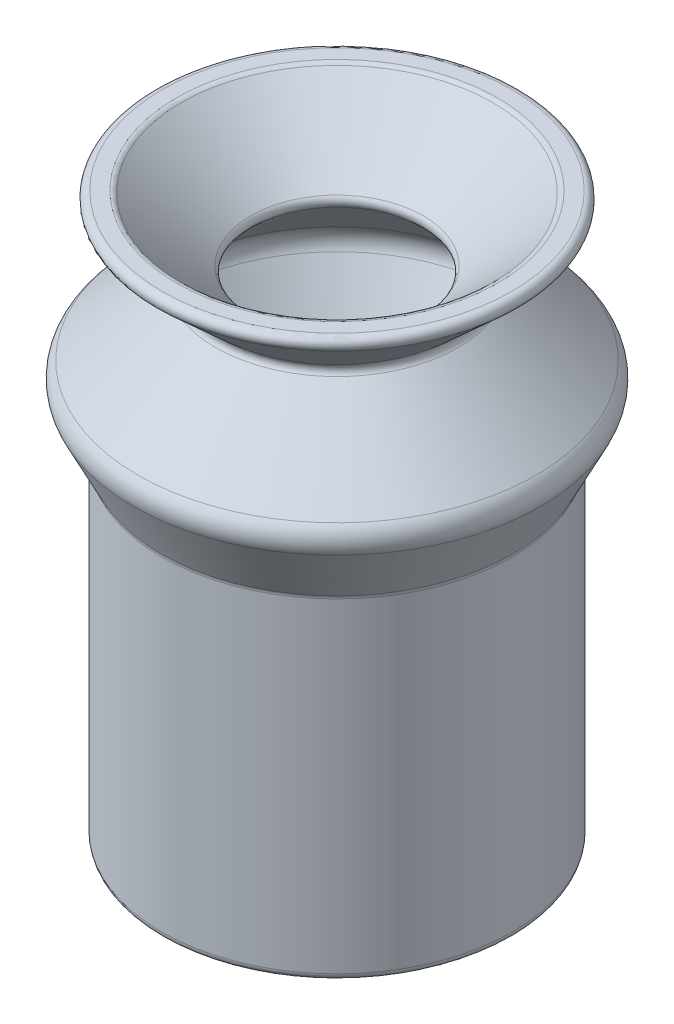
ISO-10303-21;
HEADER;
FILE_DESCRIPTION(('STEP AP214'),'2;1');
FILE_NAME('part.step','',(''),(''),'','','');
FILE_SCHEMA(('AUTOMOTIVE_DESIGN { 1 0 10303 214 1 1 1 1 }'));
ENDSEC;
DATA;
#1=APPLICATION_CONTEXT('core data for automotive mechanical design processes');
#2=APPLICATION_PROTOCOL_DEFINITION('international standard','automotive_design',2000,#1);
#3=PRODUCT_CONTEXT('',#1,'mechanical');
#4=PRODUCT('Part','Part','',(#3));
#5=PRODUCT_RELATED_PRODUCT_CATEGORY('part','',(#4));
#6=PRODUCT_DEFINITION_FORMATION('','',#4);
#7=PRODUCT_DEFINITION_CONTEXT('part definition',#1,'design');
#8=PRODUCT_DEFINITION('design','',#6,#7);
#9=PRODUCT_DEFINITION_SHAPE('','',#8);
#10=(LENGTH_UNIT() NAMED_UNIT(*) SI_UNIT(.MILLI.,.METRE.));
#11=(NAMED_UNIT(*) PLANE_ANGLE_UNIT() SI_UNIT($,.RADIAN.));
#12=(NAMED_UNIT(*) SI_UNIT($,.STERADIAN.) SOLID_ANGLE_UNIT());
#13=UNCERTAINTY_MEASURE_WITH_UNIT(LENGTH_MEASURE(1.E-05),#10,'distance_accuracy_value','');
#14=(GEOMETRIC_REPRESENTATION_CONTEXT(3) GLOBAL_UNCERTAINTY_ASSIGNED_CONTEXT((#13)) GLOBAL_UNIT_ASSIGNED_CONTEXT((#10,
#11,#12)) REPRESENTATION_CONTEXT('',''));
#15=CARTESIAN_POINT('',(0.,0.,0.));
#16=DIRECTION('',(0.,0.,1.));
#17=DIRECTION('',(1.,0.,0.));
#18=AXIS2_PLACEMENT_3D('',#15,#16,#17);
#19=CARTESIAN_POINT('',(0.,9.5,0.));
#20=DIRECTION('',(0.,-1.,0.));
#21=DIRECTION('',(0.,0.,-1.));
#22=AXIS2_PLACEMENT_3D('',#19,#20,#21);
#23=CYLINDRICAL_SURFACE('',#22,5.);
#24=CARTESIAN_POINT('',(0.,9.45278640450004,0.));
#25=DIRECTION('',(0.,1.,0.));
#26=DIRECTION('',(0.,0.,1.));
#27=AXIS2_PLACEMENT_3D('',#24,#25,#26);
#28=CIRCLE('',#27,5.);
#29=CARTESIAN_POINT('',(0.,9.45278640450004,5.));
#30=VERTEX_POINT('',#29);
#31=EDGE_CURVE('E59',#30,#30,#28,.F.);
#32=ORIENTED_EDGE('',*,*,#31,.T.);
#33=EDGE_LOOP('',(#32));
#34=FACE_BOUND('',#33,.T.);
#35=CARTESIAN_POINT('',(0.,0.200000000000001,0.));
#36=DIRECTION('',(0.,1.,0.));
#37=DIRECTION('',(0.,0.,1.));
#38=AXIS2_PLACEMENT_3D('',#35,#36,#37);
#39=CIRCLE('',#38,5.);
#40=CARTESIAN_POINT('',(0.,0.200000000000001,5.));
#41=VERTEX_POINT('',#40);
#42=EDGE_CURVE('E62',#41,#41,#39,.T.);
#43=ORIENTED_EDGE('',*,*,#42,.T.);
#44=EDGE_LOOP('',(#43));
#45=FACE_BOUND('',#44,.T.);
#46=ADVANCED_FACE('F33',(#34,#45),#23,.T.);
#47=CARTESIAN_POINT('',(0.,0.,0.));
#48=DIRECTION('',(0.,1.,0.));
#49=DIRECTION('',(0.,0.,1.));
#50=AXIS2_PLACEMENT_3D('',#47,#48,#49);
#51=PLANE('',#50);
#52=CARTESIAN_POINT('',(0.,0.,0.));
#53=DIRECTION('',(0.,1.,0.));
#54=DIRECTION('',(0.,0.,1.));
#55=AXIS2_PLACEMENT_3D('',#52,#53,#54);
#56=CIRCLE('',#55,2.5);
#57=CARTESIAN_POINT('',(0.,0.,2.5));
#58=VERTEX_POINT('',#57);
#59=EDGE_CURVE('E53',#58,#58,#56,.T.);
#60=ORIENTED_EDGE('',*,*,#59,.T.);
#61=EDGE_LOOP('',(#60));
#62=FACE_BOUND('',#61,.T.);
#63=CARTESIAN_POINT('',(0.,0.,0.));
#64=DIRECTION('',(0.,1.,0.));
#65=DIRECTION('',(0.,0.,1.));
#66=AXIS2_PLACEMENT_3D('',#63,#64,#65);
#67=CIRCLE('',#66,4.8);
#68=CARTESIAN_POINT('',(0.,0.,4.8));
#69=VERTEX_POINT('',#68);
#70=EDGE_CURVE('E56',#69,#69,#67,.F.);
#71=ORIENTED_EDGE('',*,*,#70,.T.);
#72=EDGE_LOOP('',(#71));
#73=FACE_BOUND('',#72,.T.);
#74=ADVANCED_FACE('F128',(#62,#73),#51,.F.);
#75=CARTESIAN_POINT('',(0.,11.5,0.));
#76=DIRECTION('',(0.,1.,0.));
#77=DIRECTION('',(0.,0.,1.));
#78=AXIS2_PLACEMENT_3D('',#75,#76,#77);
#79=CONICAL_SURFACE('',#78,6.,0.463647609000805);
#80=CARTESIAN_POINT('',(0.,11.0973039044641,0.));
#81=DIRECTION('',(0.,-1.,0.));
#82=DIRECTION('',(0.,0.,-1.));
#83=AXIS2_PLACEMENT_3D('',#80,#81,#82);
#84=CIRCLE('',#83,5.79865195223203);
#85=CARTESIAN_POINT('',(0.,11.0973039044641,-5.79865195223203));
#86=VERTEX_POINT('',#85);
#87=EDGE_CURVE('E10',#86,#86,#84,.T.);
#88=ORIENTED_EDGE('',*,*,#87,.T.);
#89=EDGE_LOOP('',(#88));
#90=FACE_BOUND('',#89,.T.);
#91=CARTESIAN_POINT('',(0.,9.54222912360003,0.));
#92=DIRECTION('',(0.,-1.,0.));
#93=DIRECTION('',(0.,0.,-1.));
#94=AXIS2_PLACEMENT_3D('',#91,#92,#93);
#95=CIRCLE('',#94,5.02111456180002);
#96=CARTESIAN_POINT('',(0.,9.54222912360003,-5.02111456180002));
#97=VERTEX_POINT('',#96);
#98=EDGE_CURVE('E65',#97,#97,#95,.F.);
#99=ORIENTED_EDGE('',*,*,#98,.T.);
#100=EDGE_LOOP('',(#99));
#101=FACE_BOUND('',#100,.T.);
#102=ADVANCED_FACE('F134',(#90,#101),#79,.T.);
#103=CARTESIAN_POINT('',(0.,14.,0.));
#104=DIRECTION('',(0.,-1.,0.));
#105=DIRECTION('',(0.,0.,-1.));
#106=AXIS2_PLACEMENT_3D('',#103,#104,#105);
#107=CONICAL_SURFACE('',#106,3.3,0.823840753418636);
#108=CARTESIAN_POINT('',(0.,11.8058884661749,0.));
#109=DIRECTION('',(0.,1.,0.));
#110=DIRECTION('',(0.,0.,1.));
#111=AXIS2_PLACEMENT_3D('',#108,#109,#110);
#112=CIRCLE('',#111,5.66964045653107);
#113=CARTESIAN_POINT('',(0.,11.8058884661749,5.66964045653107));
#114=VERTEX_POINT('',#113);
#115=EDGE_CURVE('E40',#114,#114,#112,.T.);
#116=ORIENTED_EDGE('',*,*,#115,.T.);
#117=EDGE_LOOP('',(#116));
#118=FACE_BOUND('',#117,.T.);
#119=CARTESIAN_POINT('',(0.,13.8518958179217,0.));
#120=DIRECTION('',(0.,-1.,0.));
#121=DIRECTION('',(0.,0.,-1.));
#122=AXIS2_PLACEMENT_3D('',#119,#120,#121);
#123=CIRCLE('',#122,3.45995251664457);
#124=CARTESIAN_POINT('',(0.,13.8518958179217,-3.45995251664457));
#125=VERTEX_POINT('',#124);
#126=EDGE_CURVE('E68',#125,#125,#123,.T.);
#127=ORIENTED_EDGE('',*,*,#126,.T.);
#128=EDGE_LOOP('',(#127));
#129=FACE_BOUND('',#128,.T.);
#130=ADVANCED_FACE('F141',(#118,#129),#107,.T.);
#131=CARTESIAN_POINT('',(0.,16.,0.));
#132=DIRECTION('',(0.,1.,0.));
#133=DIRECTION('',(0.,0.,1.));
#134=AXIS2_PLACEMENT_3D('',#131,#132,#133);
#135=CONICAL_SURFACE('',#134,5.5,0.832981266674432);
#136=CARTESIAN_POINT('',(0.,15.6520119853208,0.));
#137=DIRECTION('',(0.,-1.,0.));
#138=DIRECTION('',(0.,0.,-1.));
#139=AXIS2_PLACEMENT_3D('',#136,#137,#138);
#140=CIRCLE('',#139,5.11721318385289);
#141=CARTESIAN_POINT('',(0.,15.6520119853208,-5.11721318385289));
#142=VERTEX_POINT('',#141);
#143=EDGE_CURVE('E71',#142,#142,#140,.T.);
#144=ORIENTED_EDGE('',*,*,#143,.T.);
#145=EDGE_LOOP('',(#144));
#146=FACE_BOUND('',#145,.T.);
#147=CARTESIAN_POINT('',(0.,14.1466359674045,0.));
#148=DIRECTION('',(0.,1.,0.));
#149=DIRECTION('',(0.,0.,1.));
#150=AXIS2_PLACEMENT_3D('',#147,#148,#149);
#151=CIRCLE('',#150,3.46129956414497);
#152=CARTESIAN_POINT('',(0.,14.1466359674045,3.46129956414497));
#153=VERTEX_POINT('',#152);
#154=EDGE_CURVE('E74',#153,#153,#151,.T.);
#155=ORIENTED_EDGE('',*,*,#154,.T.);
#156=EDGE_LOOP('',(#155));
#157=FACE_BOUND('',#156,.T.);
#158=ADVANCED_FACE('F144',(#146,#157),#135,.T.);
#159=CARTESIAN_POINT('',(0.,16.,5.5));
#160=DIRECTION('',(0.,1.,0.));
#161=DIRECTION('',(0.,0.,1.));
#162=AXIS2_PLACEMENT_3D('',#159,#160,#161);
#163=PLANE('',#162);
#164=CARTESIAN_POINT('',(0.,16.,0.));
#165=DIRECTION('',(0.,1.,0.));
#166=DIRECTION('',(0.,0.,1.));
#167=AXIS2_PLACEMENT_3D('',#164,#165,#166);
#168=CIRCLE('',#167,4.57732137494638);
#169=CARTESIAN_POINT('',(0.,16.,4.57732137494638));
#170=VERTEX_POINT('',#169);
#171=EDGE_CURVE('E77',#170,#170,#168,.F.);
#172=ORIENTED_EDGE('',*,*,#171,.T.);
#173=EDGE_LOOP('',(#172));
#174=FACE_BOUND('',#173,.T.);
#175=CARTESIAN_POINT('',(0.,16.,0.));
#176=DIRECTION('',(0.,1.,0.));
#177=DIRECTION('',(0.,0.,1.));
#178=AXIS2_PLACEMENT_3D('',#175,#176,#177);
#179=CIRCLE('',#178,4.98267862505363);
#180=CARTESIAN_POINT('',(0.,16.,4.98267862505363));
#181=VERTEX_POINT('',#180);
#182=EDGE_CURVE('E80',#181,#181,#179,.T.);
#183=ORIENTED_EDGE('',*,*,#182,.T.);
#184=EDGE_LOOP('',(#183));
#185=FACE_BOUND('',#184,.T.);
#186=ADVANCED_FACE('F147',(#174,#185),#163,.T.);
#187=CARTESIAN_POINT('',(0.,9.5,0.));
#188=DIRECTION('',(0.,-1.,0.));
#189=DIRECTION('',(0.,0.,-1.));
#190=AXIS2_PLACEMENT_3D('',#187,#188,#189);
#191=PLANE('',#190);
#192=CARTESIAN_POINT('',(0.,9.5,0.));
#193=DIRECTION('',(0.,-1.,0.));
#194=DIRECTION('',(0.,0.,-1.));
#195=AXIS2_PLACEMENT_3D('',#192,#193,#194);
#196=CIRCLE('',#195,2.5);
#197=CARTESIAN_POINT('',(0.,9.5,-2.5));
#198=VERTEX_POINT('',#197);
#199=EDGE_CURVE('E101',#198,#198,#196,.T.);
#200=ORIENTED_EDGE('',*,*,#199,.T.);
#201=EDGE_LOOP('',(#200));
#202=FACE_BOUND('',#201,.T.);
#203=CARTESIAN_POINT('',(0.,9.5,0.));
#204=DIRECTION('',(0.,-1.,0.));
#205=DIRECTION('',(0.,0.,-1.));
#206=AXIS2_PLACEMENT_3D('',#203,#204,#205);
#207=CIRCLE('',#206,3.87639320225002);
#208=CARTESIAN_POINT('',(0.,9.5,-3.87639320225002));
#209=VERTEX_POINT('',#208);
#210=EDGE_CURVE('E104',#209,#209,#207,.F.);
#211=ORIENTED_EDGE('',*,*,#210,.T.);
#212=EDGE_LOOP('',(#211));
#213=FACE_BOUND('',#212,.T.);
#214=ADVANCED_FACE('F108',(#202,#213),#191,.F.);
#215=CARTESIAN_POINT('',(0.,11.5,0.));
#216=DIRECTION('',(0.,1.,0.));
#217=DIRECTION('',(0.,0.,1.));
#218=AXIS2_PLACEMENT_3D('',#215,#216,#217);
#219=CONICAL_SURFACE('',#218,5.,0.463647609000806);
#220=CARTESIAN_POINT('',(0.,11.0973039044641,0.));
#221=DIRECTION('',(0.,1.,0.));
#222=DIRECTION('',(0.,0.,1.));
#223=AXIS2_PLACEMENT_3D('',#220,#221,#222);
#224=CIRCLE('',#223,4.79865195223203);
#225=CARTESIAN_POINT('',(0.,11.0973039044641,4.79865195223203));
#226=VERTEX_POINT('',#225);
#227=EDGE_CURVE('E48',#226,#226,#224,.T.);
#228=ORIENTED_EDGE('',*,*,#227,.T.);
#229=EDGE_LOOP('',(#228));
#230=FACE_BOUND('',#229,.T.);
#231=CARTESIAN_POINT('',(0.,9.61055728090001,0.));
#232=DIRECTION('',(0.,1.,0.));
#233=DIRECTION('',(0.,0.,1.));
#234=AXIS2_PLACEMENT_3D('',#231,#232,#233);
#235=CIRCLE('',#234,4.05527864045);
#236=CARTESIAN_POINT('',(0.,9.61055728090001,4.05527864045));
#237=VERTEX_POINT('',#236);
#238=EDGE_CURVE('E92',#237,#237,#235,.F.);
#239=ORIENTED_EDGE('',*,*,#238,.T.);
#240=EDGE_LOOP('',(#239));
#241=FACE_BOUND('',#240,.T.);
#242=ADVANCED_FACE('F154',(#230,#241),#219,.F.);
#243=CARTESIAN_POINT('',(0.,14.,0.));
#244=DIRECTION('',(0.,-1.,0.));
#245=DIRECTION('',(0.,0.,-1.));
#246=AXIS2_PLACEMENT_3D('',#243,#244,#245);
#247=CONICAL_SURFACE('',#246,2.3,0.823840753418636);
#248=CARTESIAN_POINT('',(0.,11.8058884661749,0.));
#249=DIRECTION('',(0.,-1.,0.));
#250=DIRECTION('',(0.,0.,-1.));
#251=AXIS2_PLACEMENT_3D('',#248,#249,#250);
#252=CIRCLE('',#251,4.66964045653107);
#253=CARTESIAN_POINT('',(0.,11.8058884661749,-4.66964045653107));
#254=VERTEX_POINT('',#253);
#255=EDGE_CURVE('E44',#254,#254,#252,.T.);
#256=ORIENTED_EDGE('',*,*,#255,.T.);
#257=EDGE_LOOP('',(#256));
#258=FACE_BOUND('',#257,.T.);
#259=CARTESIAN_POINT('',(0.,13.8518958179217,0.));
#260=DIRECTION('',(0.,1.,0.));
#261=DIRECTION('',(0.,0.,1.));
#262=AXIS2_PLACEMENT_3D('',#259,#260,#261);
#263=CIRCLE('',#262,2.45995251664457);
#264=CARTESIAN_POINT('',(0.,13.8518958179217,2.45995251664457));
#265=VERTEX_POINT('',#264);
#266=EDGE_CURVE('E89',#265,#265,#263,.T.);
#267=ORIENTED_EDGE('',*,*,#266,.T.);
#268=EDGE_LOOP('',(#267));
#269=FACE_BOUND('',#268,.T.);
#270=ADVANCED_FACE('F158',(#258,#269),#247,.F.);
#271=CARTESIAN_POINT('',(0.,16.,0.));
#272=DIRECTION('',(0.,1.,0.));
#273=DIRECTION('',(0.,0.,1.));
#274=AXIS2_PLACEMENT_3D('',#271,#272,#273);
#275=CONICAL_SURFACE('',#274,4.5,0.832981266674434);
#276=CARTESIAN_POINT('',(0.,14.1466359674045,0.));
#277=DIRECTION('',(0.,-1.,0.));
#278=DIRECTION('',(0.,0.,-1.));
#279=AXIS2_PLACEMENT_3D('',#276,#277,#278);
#280=CIRCLE('',#279,2.46129956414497);
#281=CARTESIAN_POINT('',(0.,14.1466359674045,-2.46129956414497));
#282=VERTEX_POINT('',#281);
#283=EDGE_CURVE('E83',#282,#282,#280,.T.);
#284=ORIENTED_EDGE('',*,*,#283,.T.);
#285=EDGE_LOOP('',(#284));
#286=FACE_BOUND('',#285,.T.);
#287=CARTESIAN_POINT('',(0.,15.9479880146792,0.));
#288=DIRECTION('',(0.,1.,0.));
#289=DIRECTION('',(0.,0.,1.));
#290=AXIS2_PLACEMENT_3D('',#287,#288,#289);
#291=CIRCLE('',#290,4.44278681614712);
#292=CARTESIAN_POINT('',(0.,15.9479880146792,4.44278681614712));
#293=VERTEX_POINT('',#292);
#294=EDGE_CURVE('E86',#293,#293,#291,.T.);
#295=ORIENTED_EDGE('',*,*,#294,.T.);
#296=EDGE_LOOP('',(#295));
#297=FACE_BOUND('',#296,.T.);
#298=ADVANCED_FACE('F162',(#286,#297),#275,.F.);
#299=CARTESIAN_POINT('',(0.,9.5,0.));
#300=DIRECTION('',(0.,-1.,0.));
#301=DIRECTION('',(0.,0.,-1.));
#302=AXIS2_PLACEMENT_3D('',#299,#300,#301);
#303=CYLINDRICAL_SURFACE('',#302,2.3);
#304=CARTESIAN_POINT('',(0.,9.3,0.));
#305=DIRECTION('',(0.,-1.,0.));
#306=DIRECTION('',(0.,0.,-1.));
#307=AXIS2_PLACEMENT_3D('',#304,#305,#306);
#308=CIRCLE('',#307,2.3);
#309=CARTESIAN_POINT('',(0.,9.3,-2.3));
#310=VERTEX_POINT('',#309);
#311=EDGE_CURVE('E95',#310,#310,#308,.F.);
#312=ORIENTED_EDGE('',*,*,#311,.T.);
#313=EDGE_LOOP('',(#312));
#314=FACE_BOUND('',#313,.T.);
#315=CARTESIAN_POINT('',(0.,0.200000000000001,0.));
#316=DIRECTION('',(0.,1.,0.));
#317=DIRECTION('',(0.,0.,1.));
#318=AXIS2_PLACEMENT_3D('',#315,#316,#317);
#319=CIRCLE('',#318,2.3);
#320=CARTESIAN_POINT('',(0.,0.200000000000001,2.3));
#321=VERTEX_POINT('',#320);
#322=EDGE_CURVE('E98',#321,#321,#319,.F.);
#323=ORIENTED_EDGE('',*,*,#322,.T.);
#324=EDGE_LOOP('',(#323));
#325=FACE_BOUND('',#324,.T.);
#326=ADVANCED_FACE('F123',(#314,#325),#303,.F.);
#327=CARTESIAN_POINT('',(0.,9.3,0.));
#328=DIRECTION('',(0.,-1.,0.));
#329=DIRECTION('',(0.,0.,-1.));
#330=AXIS2_PLACEMENT_3D('',#327,#328,#329);
#331=TOROIDAL_SURFACE('',#330,2.5,0.2);
#332=ORIENTED_EDGE('',*,*,#311,.F.);
#333=EDGE_LOOP('',(#332));
#334=FACE_BOUND('',#333,.T.);
#335=ORIENTED_EDGE('',*,*,#199,.F.);
#336=EDGE_LOOP('',(#335));
#337=FACE_BOUND('',#336,.T.);
#338=ADVANCED_FACE('F113',(#334,#337),#331,.T.);
#339=CARTESIAN_POINT('',(0.,9.7,0.));
#340=DIRECTION('',(0.,-1.,0.));
#341=DIRECTION('',(0.,0.,-1.));
#342=AXIS2_PLACEMENT_3D('',#339,#340,#341);
#343=TOROIDAL_SURFACE('',#342,3.87639320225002,0.2);
#344=ORIENTED_EDGE('',*,*,#238,.F.);
#345=EDGE_LOOP('',(#344));
#346=FACE_BOUND('',#345,.T.);
#347=ORIENTED_EDGE('',*,*,#210,.F.);
#348=EDGE_LOOP('',(#347));
#349=FACE_BOUND('',#348,.T.);
#350=ADVANCED_FACE('F110',(#346,#349),#343,.F.);
#351=CARTESIAN_POINT('',(0.,13.9986479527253,0.));
#352=DIRECTION('',(0.,-1.,0.));
#353=DIRECTION('',(0.,0.,-1.));
#354=AXIS2_PLACEMENT_3D('',#351,#352,#353);
#355=TOROIDAL_SURFACE('',#354,2.59583412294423,0.2);
#356=ORIENTED_EDGE('',*,*,#283,.F.);
#357=EDGE_LOOP('',(#356));
#358=FACE_BOUND('',#357,.T.);
#359=ORIENTED_EDGE('',*,*,#266,.F.);
#360=EDGE_LOOP('',(#359));
#361=FACE_BOUND('',#360,.T.);
#362=ADVANCED_FACE('F112',(#358,#361),#355,.T.);
#363=CARTESIAN_POINT('',(0.,15.8,0.));
#364=DIRECTION('',(0.,1.,0.));
#365=DIRECTION('',(0.,0.,1.));
#366=AXIS2_PLACEMENT_3D('',#363,#364,#365);
#367=TOROIDAL_SURFACE('',#366,4.57732137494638,0.2);
#368=ORIENTED_EDGE('',*,*,#171,.F.);
#369=EDGE_LOOP('',(#368));
#370=FACE_BOUND('',#369,.T.);
#371=ORIENTED_EDGE('',*,*,#294,.F.);
#372=EDGE_LOOP('',(#371));
#373=FACE_BOUND('',#372,.T.);
#374=ADVANCED_FACE('F120',(#370,#373),#367,.T.);
#375=CARTESIAN_POINT('',(0.,15.8,0.));
#376=DIRECTION('',(0.,1.,0.));
#377=DIRECTION('',(0.,0.,1.));
#378=AXIS2_PLACEMENT_3D('',#375,#376,#377);
#379=TOROIDAL_SURFACE('',#378,4.98267862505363,0.2);
#380=ORIENTED_EDGE('',*,*,#143,.F.);
#381=EDGE_LOOP('',(#380));
#382=FACE_BOUND('',#381,.T.);
#383=ORIENTED_EDGE('',*,*,#182,.F.);
#384=EDGE_LOOP('',(#383));
#385=FACE_BOUND('',#384,.T.);
#386=ADVANCED_FACE('F266',(#382,#385),#379,.T.);
#387=CARTESIAN_POINT('',(0.,13.9986479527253,0.));
#388=DIRECTION('',(0.,1.,0.));
#389=DIRECTION('',(0.,0.,1.));
#390=AXIS2_PLACEMENT_3D('',#387,#388,#389);
#391=TOROIDAL_SURFACE('',#390,3.59583412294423,0.2);
#392=ORIENTED_EDGE('',*,*,#126,.F.);
#393=EDGE_LOOP('',(#392));
#394=FACE_BOUND('',#393,.T.);
#395=ORIENTED_EDGE('',*,*,#154,.F.);
#396=EDGE_LOOP('',(#395));
#397=FACE_BOUND('',#396,.T.);
#398=ADVANCED_FACE('F188',(#394,#397),#391,.F.);
#399=CARTESIAN_POINT('',(0.,9.45278640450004,0.));
#400=DIRECTION('',(0.,1.,0.));
#401=DIRECTION('',(0.,0.,1.));
#402=AXIS2_PLACEMENT_3D('',#399,#400,#401);
#403=TOROIDAL_SURFACE('',#402,5.2,0.2);
#404=ORIENTED_EDGE('',*,*,#31,.F.);
#405=EDGE_LOOP('',(#404));
#406=FACE_BOUND('',#405,.T.);
#407=ORIENTED_EDGE('',*,*,#98,.F.);
#408=EDGE_LOOP('',(#407));
#409=FACE_BOUND('',#408,.T.);
#410=ADVANCED_FACE('F178',(#406,#409),#403,.F.);
#411=CARTESIAN_POINT('',(0.,0.200000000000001,0.));
#412=DIRECTION('',(0.,1.,0.));
#413=DIRECTION('',(0.,0.,1.));
#414=AXIS2_PLACEMENT_3D('',#411,#412,#413);
#415=TOROIDAL_SURFACE('',#414,2.5,0.2);
#416=ORIENTED_EDGE('',*,*,#59,.F.);
#417=EDGE_LOOP('',(#416));
#418=FACE_BOUND('',#417,.T.);
#419=ORIENTED_EDGE('',*,*,#322,.F.);
#420=EDGE_LOOP('',(#419));
#421=FACE_BOUND('',#420,.T.);
#422=ADVANCED_FACE('F175',(#418,#421),#415,.T.);
#423=CARTESIAN_POINT('',(0.,0.200000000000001,0.));
#424=DIRECTION('',(0.,1.,0.));
#425=DIRECTION('',(0.,0.,1.));
#426=AXIS2_PLACEMENT_3D('',#423,#424,#425);
#427=TOROIDAL_SURFACE('',#426,4.8,0.2);
#428=ORIENTED_EDGE('',*,*,#70,.F.);
#429=EDGE_LOOP('',(#428));
#430=FACE_BOUND('',#429,.T.);
#431=ORIENTED_EDGE('',*,*,#42,.F.);
#432=EDGE_LOOP('',(#431));
#433=FACE_BOUND('',#432,.T.);
#434=ADVANCED_FACE('F177',(#430,#433),#427,.T.);
#435=CARTESIAN_POINT('',(0.,11.365632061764,0.));
#436=DIRECTION('',(0.,1.,0.));
#437=DIRECTION('',(0.,0.,1.));
#438=AXIS2_PLACEMENT_3D('',#435,#436,#437);
#439=TOROIDAL_SURFACE('',#438,4.26199563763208,0.6);
#440=ORIENTED_EDGE('',*,*,#255,.F.);
#441=EDGE_LOOP('',(#440));
#442=FACE_BOUND('',#441,.T.);
#443=ORIENTED_EDGE('',*,*,#227,.F.);
#444=EDGE_LOOP('',(#443));
#445=FACE_BOUND('',#444,.T.);
#446=ADVANCED_FACE('F185',(#442,#445),#439,.F.);
#447=CARTESIAN_POINT('',(0.,11.365632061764,0.));
#448=DIRECTION('',(0.,-1.,0.));
#449=DIRECTION('',(0.,0.,-1.));
#450=AXIS2_PLACEMENT_3D('',#447,#448,#449);
#451=TOROIDAL_SURFACE('',#450,5.26199563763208,0.6);
#452=ORIENTED_EDGE('',*,*,#87,.F.);
#453=EDGE_LOOP('',(#452));
#454=FACE_BOUND('',#453,.T.);
#455=ORIENTED_EDGE('',*,*,#115,.F.);
#456=EDGE_LOOP('',(#455));
#457=FACE_BOUND('',#456,.T.);
#458=ADVANCED_FACE('F35',(#454,#457),#451,.T.);
#459=CLOSED_SHELL('',(#46,#74,#102,#130,#158,#186,#214,#242,#270,#298,#326,#338,#350,#362,#374,
#386,#398,#410,#422,#434,#446,#458));
#460=MANIFOLD_SOLID_BREP('B2',#459);
#461=ADVANCED_BREP_SHAPE_REPRESENTATION('',(#18,#460),#14);
#462=SHAPE_DEFINITION_REPRESENTATION(#9,#461);
ENDSEC;
END-ISO-10303-21;
